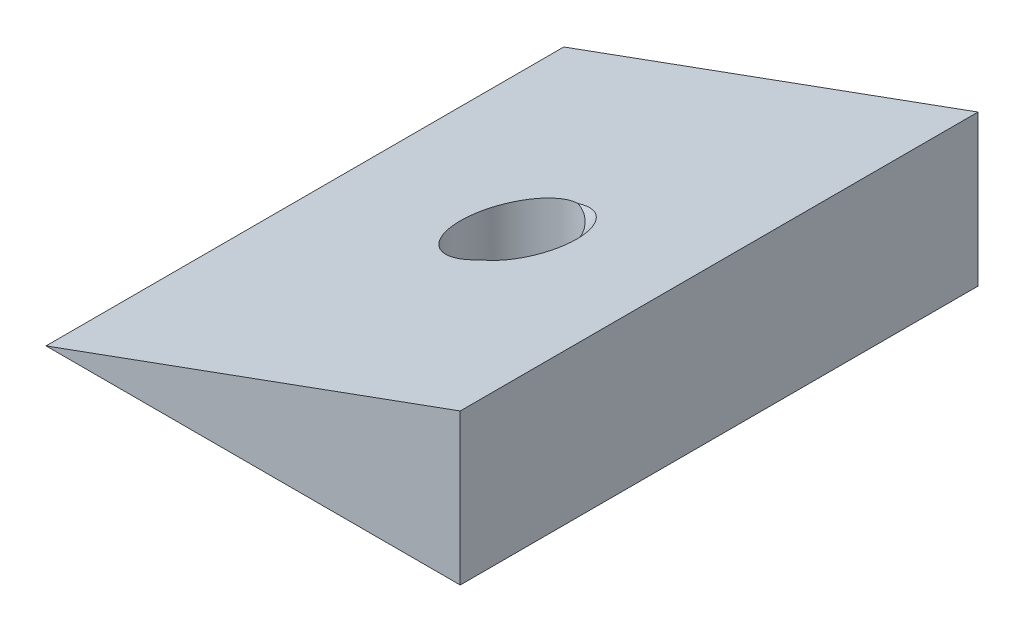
ISO-10303-21;
HEADER;
FILE_DESCRIPTION(('STEP AP214'),'2;1');
FILE_NAME('part.step','',(''),(''),'','','');
FILE_SCHEMA(('AUTOMOTIVE_DESIGN { 1 0 10303 214 1 1 1 1 }'));
ENDSEC;
DATA;
#1=APPLICATION_CONTEXT('core data for automotive mechanical design processes');
#2=APPLICATION_PROTOCOL_DEFINITION('international standard','automotive_design',2000,#1);
#3=PRODUCT_CONTEXT('',#1,'mechanical');
#4=PRODUCT('Part','Part','',(#3));
#5=PRODUCT_RELATED_PRODUCT_CATEGORY('part','',(#4));
#6=PRODUCT_DEFINITION_FORMATION('','',#4);
#7=PRODUCT_DEFINITION_CONTEXT('part definition',#1,'design');
#8=PRODUCT_DEFINITION('design','',#6,#7);
#9=PRODUCT_DEFINITION_SHAPE('','',#8);
#10=(LENGTH_UNIT() NAMED_UNIT(*) SI_UNIT(.MILLI.,.METRE.));
#11=(NAMED_UNIT(*) PLANE_ANGLE_UNIT() SI_UNIT($,.RADIAN.));
#12=(NAMED_UNIT(*) SI_UNIT($,.STERADIAN.) SOLID_ANGLE_UNIT());
#13=UNCERTAINTY_MEASURE_WITH_UNIT(LENGTH_MEASURE(1.E-05),#10,'distance_accuracy_value','');
#14=(GEOMETRIC_REPRESENTATION_CONTEXT(3) GLOBAL_UNCERTAINTY_ASSIGNED_CONTEXT((#13)) GLOBAL_UNIT_ASSIGNED_CONTEXT((#10,
#11,#12)) REPRESENTATION_CONTEXT('',''));
#15=CARTESIAN_POINT('',(0.,0.,0.));
#16=DIRECTION('',(0.,0.,1.));
#17=DIRECTION('',(1.,0.,0.));
#18=AXIS2_PLACEMENT_3D('',#15,#16,#17);
#19=CARTESIAN_POINT('',(24.440290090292,2.26327107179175,26.5500157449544));
#20=DIRECTION('',(1.,0.,0.));
#21=DIRECTION('',(0.,0.,-1.));
#22=AXIS2_PLACEMENT_3D('',#19,#20,#21);
#23=PLANE('',#22);
#24=DIRECTION('',(0.,0.,1.));
#25=VECTOR('',#24,1.);
#26=CARTESIAN_POINT('',(24.440290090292,2.26327107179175,19.0500116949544));
#27=LINE('',#26,#25);
#28=CARTESIAN_POINT('',(24.440290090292,2.26327107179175,11.5500076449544));
#29=VERTEX_POINT('',#28);
#30=CARTESIAN_POINT('',(24.440290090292,2.26327107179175,26.5500157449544));
#31=VERTEX_POINT('',#30);
#32=EDGE_CURVE('E87',#29,#31,#27,.T.);
#33=ORIENTED_EDGE('',*,*,#32,.F.);
#34=DIRECTION('',(0.,-1.,0.));
#35=VECTOR('',#34,1.);
#36=CARTESIAN_POINT('',(24.440290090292,4.46019659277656,11.5500076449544));
#37=LINE('',#36,#35);
#38=CARTESIAN_POINT('',(24.440290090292,6.63091624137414,11.5500076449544));
#39=VERTEX_POINT('',#38);
#40=EDGE_CURVE('E106',#39,#29,#37,.T.);
#41=ORIENTED_EDGE('',*,*,#40,.F.);
#42=DIRECTION('',(0.,0.,-1.));
#43=VECTOR('',#42,1.);
#44=CARTESIAN_POINT('',(24.440290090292,6.63091624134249,19.0500116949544));
#45=LINE('',#44,#43);
#46=CARTESIAN_POINT('',(24.440290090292,6.63091624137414,26.5500157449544));
#47=VERTEX_POINT('',#46);
#48=EDGE_CURVE('E97',#47,#39,#45,.T.);
#49=ORIENTED_EDGE('',*,*,#48,.F.);
#50=DIRECTION('',(0.,1.,0.));
#51=VECTOR('',#50,1.);
#52=CARTESIAN_POINT('',(24.440290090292,4.46019659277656,26.5500157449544));
#53=LINE('',#52,#51);
#54=EDGE_CURVE('E90',#31,#47,#53,.T.);
#55=ORIENTED_EDGE('',*,*,#54,.F.);
#56=EDGE_LOOP('',(#33,#41,#49,#55));
#57=FACE_BOUND('',#56,.T.);
#58=ADVANCED_FACE('F34',(#57),#23,.T.);
#59=CARTESIAN_POINT('',(24.440290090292,2.26327107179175,11.5500076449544));
#60=DIRECTION('',(0.,0.,-1.));
#61=DIRECTION('',(-1.,0.,0.));
#62=AXIS2_PLACEMENT_3D('',#59,#60,#61);
#63=PLANE('',#62);
#64=ORIENTED_EDGE('',*,*,#40,.T.);
#65=DIRECTION('',(1.,0.,0.));
#66=VECTOR('',#65,1.);
#67=CARTESIAN_POINT('',(18.440286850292,2.26327107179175,11.5500076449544));
#68=LINE('',#67,#66);
#69=CARTESIAN_POINT('',(12.440283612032,2.26327107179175,11.5500076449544));
#70=VERTEX_POINT('',#69);
#71=EDGE_CURVE('E91',#70,#29,#68,.T.);
#72=ORIENTED_EDGE('',*,*,#71,.F.);
#73=DIRECTION('',(-0.939692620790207,-0.342020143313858,0.));
#74=VECTOR('',#73,1.);
#75=CARTESIAN_POINT('',(18.440286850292,4.44709365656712,11.5500076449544));
#76=LINE('',#75,#74);
#77=EDGE_CURVE('E78',#39,#70,#76,.T.);
#78=ORIENTED_EDGE('',*,*,#77,.F.);
#79=EDGE_LOOP('',(#64,#72,#78));
#80=FACE_BOUND('',#79,.T.);
#81=ADVANCED_FACE('F109',(#80),#63,.T.);
#82=CARTESIAN_POINT('',(12.440283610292,2.26327107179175,26.5500157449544));
#83=DIRECTION('',(0.,-1.,0.));
#84=DIRECTION('',(0.,0.,-1.));
#85=AXIS2_PLACEMENT_3D('',#82,#83,#84);
#86=PLANE('',#85);
#87=CARTESIAN_POINT('',(18.440286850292,2.26327107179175,19.0500116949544));
#88=DIRECTION('',(0.,1.,0.));
#89=DIRECTION('',(0.,0.,1.));
#90=AXIS2_PLACEMENT_3D('',#87,#88,#89);
#91=CIRCLE('',#90,1.50000081);
#92=CARTESIAN_POINT('',(18.440286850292,2.26327107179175,20.5500125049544));
#93=VERTEX_POINT('',#92);
#94=EDGE_CURVE('E38',#93,#93,#91,.F.);
#95=ORIENTED_EDGE('',*,*,#94,.F.);
#96=EDGE_LOOP('',(#95));
#97=FACE_BOUND('',#96,.T.);
#98=DIRECTION('',(0.,0.,1.));
#99=VECTOR('',#98,1.);
#100=CARTESIAN_POINT('',(12.440283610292,2.26327107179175,19.0500116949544));
#101=LINE('',#100,#99);
#102=CARTESIAN_POINT('',(12.440283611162,2.26327107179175,26.5500157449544));
#103=VERTEX_POINT('',#102);
#104=EDGE_CURVE('E72',#70,#103,#101,.T.);
#105=ORIENTED_EDGE('',*,*,#104,.F.);
#106=ORIENTED_EDGE('',*,*,#71,.T.);
#107=ORIENTED_EDGE('',*,*,#32,.T.);
#108=DIRECTION('',(1.,0.,0.));
#109=VECTOR('',#108,1.);
#110=CARTESIAN_POINT('',(18.404286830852,2.26327107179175,26.5500157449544));
#111=LINE('',#110,#109);
#112=EDGE_CURVE('E84',#103,#31,#111,.T.);
#113=ORIENTED_EDGE('',*,*,#112,.F.);
#114=EDGE_LOOP('',(#105,#106,#107,#113));
#115=FACE_BOUND('',#114,.T.);
#116=ADVANCED_FACE('F85',(#97,#115),#86,.T.);
#117=CARTESIAN_POINT('',(12.368283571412,2.26327107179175,26.5500157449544));
#118=DIRECTION('',(0.,0.,1.));
#119=DIRECTION('',(1.,0.,0.));
#120=AXIS2_PLACEMENT_3D('',#117,#118,#119);
#121=PLANE('',#120);
#122=ORIENTED_EDGE('',*,*,#112,.T.);
#123=ORIENTED_EDGE('',*,*,#54,.T.);
#124=DIRECTION('',(0.939692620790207,0.342020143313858,0.));
#125=VECTOR('',#124,1.);
#126=CARTESIAN_POINT('',(18.440286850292,4.44709365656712,26.5500157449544));
#127=LINE('',#126,#125);
#128=EDGE_CURVE('E75',#103,#47,#127,.T.);
#129=ORIENTED_EDGE('',*,*,#128,.F.);
#130=EDGE_LOOP('',(#122,#123,#129));
#131=FACE_BOUND('',#130,.T.);
#132=ADVANCED_FACE('F93',(#131),#121,.T.);
#133=CARTESIAN_POINT('',(18.440286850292,2.26327107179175,19.0500116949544));
#134=DIRECTION('',(0.,1.,0.));
#135=DIRECTION('',(0.,0.,1.));
#136=AXIS2_PLACEMENT_3D('',#133,#134,#135);
#137=CYLINDRICAL_SURFACE('',#136,1.50000081);
#138=ORIENTED_EDGE('',*,*,#94,.T.);
#139=EDGE_LOOP('',(#138));
#140=FACE_BOUND('',#139,.T.);
#141=CARTESIAN_POINT('',(18.440286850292,4.6309151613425,19.0500116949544));
#142=DIRECTION('',(0.,1.,0.));
#143=DIRECTION('',(1.,0.,0.));
#144=AXIS2_PLACEMENT_3D('',#141,#142,#143);
#145=CIRCLE('',#144,1.50000081);
#146=CARTESIAN_POINT('',(18.9453322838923,4.6309151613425,17.637591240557));
#147=VERTEX_POINT('',#146);
#148=CARTESIAN_POINT('',(18.9453322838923,4.63091516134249,20.4624321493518));
#149=VERTEX_POINT('',#148);
#150=EDGE_CURVE('E44',#147,#149,#145,.F.);
#151=ORIENTED_EDGE('',*,*,#150,.F.);
#152=CARTESIAN_POINT('',(18.440286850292,4.44709365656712,19.0500116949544));
#153=DIRECTION('',(-0.342020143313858,0.939692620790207,0.));
#154=DIRECTION('',(0.939692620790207,0.342020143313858,0.));
#155=AXIS2_PLACEMENT_3D('',#152,#153,#154);
#156=ELLIPSE('',#155,1.59626752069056,1.50000081);
#157=EDGE_CURVE('E50',#149,#147,#156,.F.);
#158=ORIENTED_EDGE('',*,*,#157,.F.);
#159=EDGE_LOOP('',(#151,#158));
#160=FACE_BOUND('',#159,.T.);
#161=ADVANCED_FACE('F125',(#140,#160),#137,.F.);
#162=CARTESIAN_POINT('',(24.440290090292,6.63091624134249,11.5500076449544));
#163=DIRECTION('',(-0.342020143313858,0.939692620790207,0.));
#164=DIRECTION('',(-0.939692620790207,-0.342020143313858,0.));
#165=AXIS2_PLACEMENT_3D('',#162,#163,#164);
#166=PLANE('',#165);
#167=ORIENTED_EDGE('',*,*,#157,.T.);
#168=CARTESIAN_POINT('',(18.8420579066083,4.59332636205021,19.0500116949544));
#169=DIRECTION('',(-0.342020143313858,0.939692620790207,0.));
#170=DIRECTION('',(0.939692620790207,0.342020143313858,0.));
#171=AXIS2_PLACEMENT_3D('',#168,#169,#170);
#172=ELLIPSE('',#171,1.56626664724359,1.41591043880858);
#173=EDGE_CURVE('E11',#149,#147,#172,.T.);
#174=ORIENTED_EDGE('',*,*,#173,.F.);
#175=EDGE_LOOP('',(#167,#174));
#176=FACE_BOUND('',#175,.T.);
#177=ORIENTED_EDGE('',*,*,#104,.T.);
#178=ORIENTED_EDGE('',*,*,#128,.T.);
#179=ORIENTED_EDGE('',*,*,#48,.T.);
#180=ORIENTED_EDGE('',*,*,#77,.T.);
#181=EDGE_LOOP('',(#177,#178,#179,#180));
#182=FACE_BOUND('',#181,.T.);
#183=ADVANCED_FACE('F36',(#176,#182),#166,.T.);
#184=CARTESIAN_POINT('',(18.440286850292,4.63091516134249,19.0500116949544));
#185=DIRECTION('',(0.,1.,0.));
#186=DIRECTION('',(0.,0.,1.));
#187=AXIS2_PLACEMENT_3D('',#184,#185,#186);
#188=CONICAL_SURFACE('',#187,1.50000081,0.643501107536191);
#189=ORIENTED_EDGE('',*,*,#150,.T.);
#190=ORIENTED_EDGE('',*,*,#173,.T.);
#191=EDGE_LOOP('',(#189,#190));
#192=FACE_BOUND('',#191,.T.);
#193=ADVANCED_FACE('F118',(#192),#188,.F.);
#194=CLOSED_SHELL('',(#58,#81,#116,#132,#161,#183,#193));
#195=MANIFOLD_SOLID_BREP('B2',#194);
#196=ADVANCED_BREP_SHAPE_REPRESENTATION('',(#18,#195),#14);
#197=SHAPE_DEFINITION_REPRESENTATION(#9,#196);
ENDSEC;
END-ISO-10303-21;
